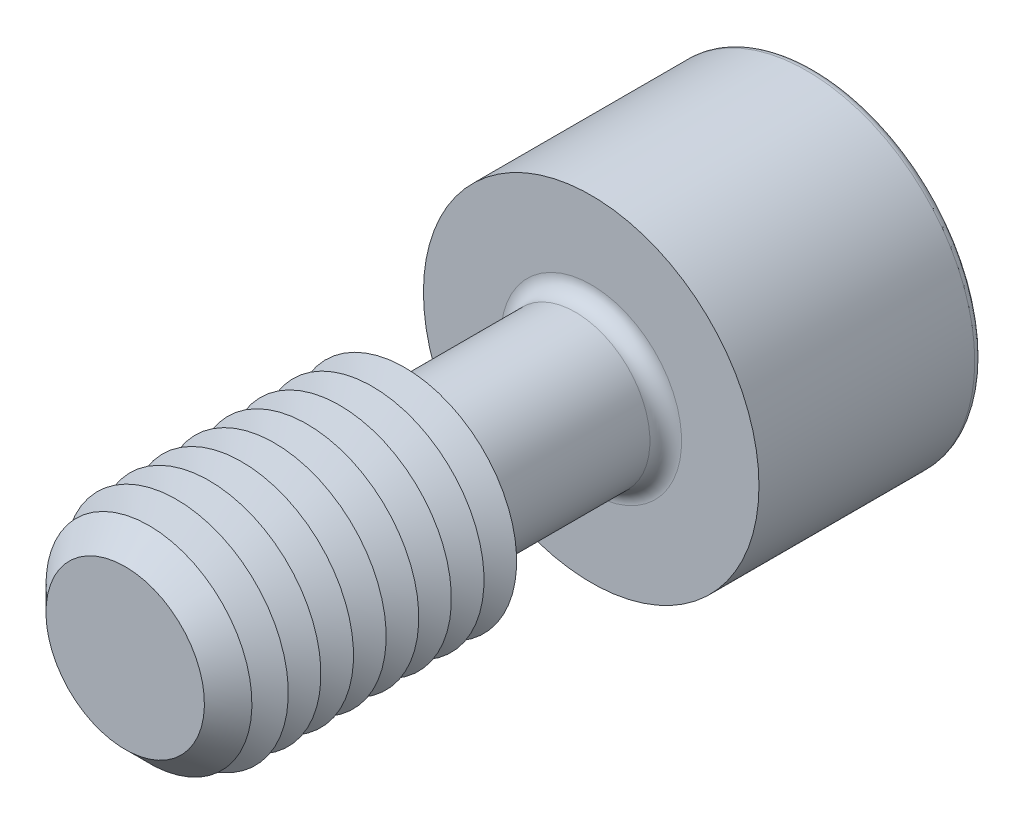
ISO-10303-21;
HEADER;
FILE_DESCRIPTION(('STEP AP214'),'2;1');
FILE_NAME('part.step','',(''),(''),'','','');
FILE_SCHEMA(('AUTOMOTIVE_DESIGN { 1 0 10303 214 1 1 1 1 }'));
ENDSEC;
DATA;
#1=APPLICATION_CONTEXT('core data for automotive mechanical design processes');
#2=APPLICATION_PROTOCOL_DEFINITION('international standard','automotive_design',2000,#1);
#3=PRODUCT_CONTEXT('',#1,'mechanical');
#4=PRODUCT('Part','Part','',(#3));
#5=PRODUCT_RELATED_PRODUCT_CATEGORY('part','',(#4));
#6=PRODUCT_DEFINITION_FORMATION('','',#4);
#7=PRODUCT_DEFINITION_CONTEXT('part definition',#1,'design');
#8=PRODUCT_DEFINITION('design','',#6,#7);
#9=PRODUCT_DEFINITION_SHAPE('','',#8);
#10=(LENGTH_UNIT() NAMED_UNIT(*) SI_UNIT(.MILLI.,.METRE.));
#11=(NAMED_UNIT(*) PLANE_ANGLE_UNIT() SI_UNIT($,.RADIAN.));
#12=(NAMED_UNIT(*) SI_UNIT($,.STERADIAN.) SOLID_ANGLE_UNIT());
#13=UNCERTAINTY_MEASURE_WITH_UNIT(LENGTH_MEASURE(1.E-05),#10,'distance_accuracy_value','');
#14=(GEOMETRIC_REPRESENTATION_CONTEXT(3) GLOBAL_UNCERTAINTY_ASSIGNED_CONTEXT((#13)) GLOBAL_UNIT_ASSIGNED_CONTEXT((#10,
#11,#12)) REPRESENTATION_CONTEXT('',''));
#15=CARTESIAN_POINT('',(0.,0.,0.));
#16=DIRECTION('',(0.,0.,1.));
#17=DIRECTION('',(1.,0.,0.));
#18=AXIS2_PLACEMENT_3D('',#15,#16,#17);
#19=CARTESIAN_POINT('',(-2.88675134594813,-5.,-14.5));
#20=DIRECTION('',(0.,0.,1.));
#21=DIRECTION('',(1.,0.,0.));
#22=AXIS2_PLACEMENT_3D('',#19,#20,#21);
#23=PLANE('',#22);
#24=DIRECTION('',(1.,0.,0.));
#25=VECTOR('',#24,1.);
#26=CARTESIAN_POINT('',(-2.88675134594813,-5.,-14.5));
#27=LINE('',#26,#25);
#28=CARTESIAN_POINT('',(0.,-5.,-14.5));
#29=VERTEX_POINT('',#28);
#30=CARTESIAN_POINT('',(2.88675134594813,-5.,-14.5));
#31=VERTEX_POINT('',#30);
#32=EDGE_CURVE('E761',#29,#31,#27,.T.);
#33=ORIENTED_EDGE('',*,*,#32,.F.);
#34=CARTESIAN_POINT('',(0.,0.,-14.5));
#35=DIRECTION('',(0.,0.,1.));
#36=DIRECTION('',(0.,-1.,0.));
#37=AXIS2_PLACEMENT_3D('',#34,#35,#36);
#38=CIRCLE('',#37,4.99999999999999);
#39=CARTESIAN_POINT('',(4.33012701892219,-2.50000000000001,-14.5));
#40=VERTEX_POINT('',#39);
#41=EDGE_CURVE('E53',#29,#40,#38,.T.);
#42=ORIENTED_EDGE('',*,*,#41,.T.);
#43=DIRECTION('',(0.5,0.866025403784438,0.));
#44=VECTOR('',#43,1.);
#45=CARTESIAN_POINT('',(2.88675134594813,-5.,-14.5));
#46=LINE('',#45,#44);
#47=EDGE_CURVE('E747',#31,#40,#46,.T.);
#48=ORIENTED_EDGE('',*,*,#47,.F.);
#49=EDGE_LOOP('',(#33,#42,#48));
#50=FACE_BOUND('',#49,.T.);
#51=ADVANCED_FACE('F41',(#50),#23,.F.);
#52=CARTESIAN_POINT('',(5.77350269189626,0.,-14.5));
#53=VERTEX_POINT('',#52);
#54=EDGE_CURVE('E758',#40,#53,#46,.T.);
#55=ORIENTED_EDGE('',*,*,#54,.F.);
#56=CARTESIAN_POINT('',(4.33012701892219,2.49999999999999,-14.5));
#57=VERTEX_POINT('',#56);
#58=EDGE_CURVE('E11',#40,#57,#38,.T.);
#59=ORIENTED_EDGE('',*,*,#58,.T.);
#60=DIRECTION('',(-0.5,0.866025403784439,0.));
#61=VECTOR('',#60,1.);
#62=CARTESIAN_POINT('',(5.77350269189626,0.,-14.5));
#63=LINE('',#62,#61);
#64=EDGE_CURVE('E746',#53,#57,#63,.T.);
#65=ORIENTED_EDGE('',*,*,#64,.F.);
#66=EDGE_LOOP('',(#55,#59,#65));
#67=FACE_BOUND('',#66,.T.);
#68=ADVANCED_FACE('F133',(#67),#23,.F.);
#69=CARTESIAN_POINT('',(2.88675134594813,5.,-14.5));
#70=VERTEX_POINT('',#69);
#71=EDGE_CURVE('E741',#57,#70,#63,.T.);
#72=ORIENTED_EDGE('',*,*,#71,.F.);
#73=CARTESIAN_POINT('',(0.,4.99999999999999,-14.5));
#74=VERTEX_POINT('',#73);
#75=EDGE_CURVE('E51',#57,#74,#38,.T.);
#76=ORIENTED_EDGE('',*,*,#75,.T.);
#77=DIRECTION('',(-1.,0.,0.));
#78=VECTOR('',#77,1.);
#79=CARTESIAN_POINT('',(2.88675134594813,5.,-14.5));
#80=LINE('',#79,#78);
#81=EDGE_CURVE('E177',#70,#74,#80,.T.);
#82=ORIENTED_EDGE('',*,*,#81,.F.);
#83=EDGE_LOOP('',(#72,#76,#82));
#84=FACE_BOUND('',#83,.T.);
#85=ADVANCED_FACE('F139',(#84),#23,.F.);
#86=CARTESIAN_POINT('',(-2.88675134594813,5.,-14.5));
#87=VERTEX_POINT('',#86);
#88=EDGE_CURVE('E752',#74,#87,#80,.T.);
#89=ORIENTED_EDGE('',*,*,#88,.F.);
#90=CARTESIAN_POINT('',(-4.33012701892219,2.49999999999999,-14.5));
#91=VERTEX_POINT('',#90);
#92=EDGE_CURVE('E264',#74,#91,#38,.T.);
#93=ORIENTED_EDGE('',*,*,#92,.T.);
#94=DIRECTION('',(-0.5,-0.866025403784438,0.));
#95=VECTOR('',#94,1.);
#96=CARTESIAN_POINT('',(-2.88675134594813,5.,-14.5));
#97=LINE('',#96,#95);
#98=EDGE_CURVE('E176',#87,#91,#97,.T.);
#99=ORIENTED_EDGE('',*,*,#98,.F.);
#100=EDGE_LOOP('',(#89,#93,#99));
#101=FACE_BOUND('',#100,.T.);
#102=ADVANCED_FACE('F157',(#101),#23,.F.);
#103=CARTESIAN_POINT('',(-5.77350269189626,0.,-14.5));
#104=VERTEX_POINT('',#103);
#105=EDGE_CURVE('E170',#91,#104,#97,.T.);
#106=ORIENTED_EDGE('',*,*,#105,.F.);
#107=CARTESIAN_POINT('',(-4.33012701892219,-2.5,-14.5));
#108=VERTEX_POINT('',#107);
#109=EDGE_CURVE('E172',#91,#108,#38,.T.);
#110=ORIENTED_EDGE('',*,*,#109,.T.);
#111=DIRECTION('',(0.5,-0.866025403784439,0.));
#112=VECTOR('',#111,1.);
#113=CARTESIAN_POINT('',(-5.77350269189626,0.,-14.5));
#114=LINE('',#113,#112);
#115=EDGE_CURVE('E174',#104,#108,#114,.T.);
#116=ORIENTED_EDGE('',*,*,#115,.F.);
#117=EDGE_LOOP('',(#106,#110,#116));
#118=FACE_BOUND('',#117,.T.);
#119=ADVANCED_FACE('F146',(#118),#23,.F.);
#120=CARTESIAN_POINT('',(0.,0.,-24.5));
#121=DIRECTION('',(0.,0.,-1.));
#122=DIRECTION('',(-1.,0.,0.));
#123=AXIS2_PLACEMENT_3D('',#120,#121,#122);
#124=PLANE('',#123);
#125=CARTESIAN_POINT('',(0.,0.,-24.5));
#126=DIRECTION('',(0.,0.,-1.));
#127=DIRECTION('',(-1.,0.,0.));
#128=AXIS2_PLACEMENT_3D('',#125,#126,#127);
#129=CIRCLE('',#128,8.575);
#130=CARTESIAN_POINT('',(-8.575,0.,-24.5));
#131=VERTEX_POINT('',#130);
#132=EDGE_CURVE('E250',#131,#131,#129,.T.);
#133=ORIENTED_EDGE('',*,*,#132,.T.);
#134=EDGE_LOOP('',(#133));
#135=FACE_BOUND('',#134,.T.);
#136=DIRECTION('',(-0.5,-0.866025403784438,0.));
#137=VECTOR('',#136,1.);
#138=CARTESIAN_POINT('',(-2.88675134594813,5.,-24.5));
#139=LINE('',#138,#137);
#140=CARTESIAN_POINT('',(-2.88675134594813,5.,-24.5));
#141=VERTEX_POINT('',#140);
#142=CARTESIAN_POINT('',(-5.77350269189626,0.,-24.5));
#143=VERTEX_POINT('',#142);
#144=EDGE_CURVE('E212',#141,#143,#139,.T.);
#145=ORIENTED_EDGE('',*,*,#144,.T.);
#146=DIRECTION('',(0.5,-0.866025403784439,0.));
#147=VECTOR('',#146,1.);
#148=CARTESIAN_POINT('',(-5.77350269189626,0.,-24.5));
#149=LINE('',#148,#147);
#150=CARTESIAN_POINT('',(-2.88675134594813,-5.,-24.5));
#151=VERTEX_POINT('',#150);
#152=EDGE_CURVE('E67',#143,#151,#149,.T.);
#153=ORIENTED_EDGE('',*,*,#152,.T.);
#154=DIRECTION('',(1.,0.,0.));
#155=VECTOR('',#154,1.);
#156=CARTESIAN_POINT('',(-2.88675134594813,-5.,-24.5));
#157=LINE('',#156,#155);
#158=CARTESIAN_POINT('',(2.88675134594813,-5.,-24.5));
#159=VERTEX_POINT('',#158);
#160=EDGE_CURVE('E196',#151,#159,#157,.T.);
#161=ORIENTED_EDGE('',*,*,#160,.T.);
#162=DIRECTION('',(0.5,0.866025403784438,0.));
#163=VECTOR('',#162,1.);
#164=CARTESIAN_POINT('',(2.88675134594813,-5.,-24.5));
#165=LINE('',#164,#163);
#166=CARTESIAN_POINT('',(5.77350269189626,0.,-24.5));
#167=VERTEX_POINT('',#166);
#168=EDGE_CURVE('E200',#159,#167,#165,.T.);
#169=ORIENTED_EDGE('',*,*,#168,.T.);
#170=DIRECTION('',(-0.5,0.866025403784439,0.));
#171=VECTOR('',#170,1.);
#172=CARTESIAN_POINT('',(5.77350269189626,0.,-24.5));
#173=LINE('',#172,#171);
#174=CARTESIAN_POINT('',(2.88675134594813,5.,-24.5));
#175=VERTEX_POINT('',#174);
#176=EDGE_CURVE('E204',#167,#175,#173,.T.);
#177=ORIENTED_EDGE('',*,*,#176,.T.);
#178=DIRECTION('',(-1.,0.,0.));
#179=VECTOR('',#178,1.);
#180=CARTESIAN_POINT('',(2.88675134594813,5.,-24.5));
#181=LINE('',#180,#179);
#182=EDGE_CURVE('E208',#175,#141,#181,.T.);
#183=ORIENTED_EDGE('',*,*,#182,.T.);
#184=EDGE_LOOP('',(#145,#153,#161,#169,#177,#183));
#185=FACE_BOUND('',#184,.T.);
#186=ADVANCED_FACE('F156',(#135,#185),#124,.T.);
#187=CARTESIAN_POINT('',(0.,0.,12.5));
#188=DIRECTION('',(0.,0.,-1.));
#189=DIRECTION('',(-1.,0.,0.));
#190=AXIS2_PLACEMENT_3D('',#187,#188,#189);
#191=CYLINDRICAL_SURFACE('',#190,4.);
#192=CARTESIAN_POINT('',(0.,0.,-11.65));
#193=DIRECTION('',(0.,0.,-1.));
#194=DIRECTION('',(-1.,0.,0.));
#195=AXIS2_PLACEMENT_3D('',#192,#193,#194);
#196=CIRCLE('',#195,4.);
#197=CARTESIAN_POINT('',(-4.,0.,-11.65));
#198=VERTEX_POINT('',#197);
#199=EDGE_CURVE('E247',#198,#198,#196,.F.);
#200=ORIENTED_EDGE('',*,*,#199,.T.);
#201=EDGE_LOOP('',(#200));
#202=FACE_BOUND('',#201,.T.);
#203=CARTESIAN_POINT('',(0.,0.,-3.65470053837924));
#204=DIRECTION('',(0.,0.,-1.));
#205=DIRECTION('',(0.,1.,0.));
#206=AXIS2_PLACEMENT_3D('',#203,#204,#205);
#207=CIRCLE('',#206,4.);
#208=CARTESIAN_POINT('',(0.,4.,-3.65470053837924));
#209=VERTEX_POINT('',#208);
#210=EDGE_CURVE('E235',#209,#209,#207,.T.);
#211=ORIENTED_EDGE('',*,*,#210,.T.);
#212=EDGE_LOOP('',(#211));
#213=FACE_BOUND('',#212,.T.);
#214=ADVANCED_FACE('F163',(#202,#213),#191,.T.);
#215=CARTESIAN_POINT('',(0.,0.,-3.65470053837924));
#216=DIRECTION('',(0.,0.,1.));
#217=DIRECTION('',(0.,-1.,0.));
#218=AXIS2_PLACEMENT_3D('',#215,#216,#217);
#219=CONICAL_SURFACE('',#218,4.,1.0471975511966);
#220=CARTESIAN_POINT('',(0.,0.,-2.5));
#221=DIRECTION('',(0.,0.,-1.));
#222=DIRECTION('',(-1.,0.,0.));
#223=AXIS2_PLACEMENT_3D('',#220,#221,#222);
#224=CIRCLE('',#223,6.);
#225=CARTESIAN_POINT('',(-6.,0.,-2.5));
#226=VERTEX_POINT('',#225);
#227=EDGE_CURVE('E268',#226,#226,#224,.T.);
#228=ORIENTED_EDGE('',*,*,#227,.T.);
#229=EDGE_LOOP('',(#228));
#230=FACE_BOUND('',#229,.T.);
#231=ORIENTED_EDGE('',*,*,#210,.F.);
#232=EDGE_LOOP('',(#231));
#233=FACE_BOUND('',#232,.T.);
#234=ADVANCED_FACE('F510',(#230,#233),#219,.T.);
#235=CARTESIAN_POINT('',(0.,0.,-12.5));
#236=DIRECTION('',(0.,0.,-1.));
#237=DIRECTION('',(-1.,0.,0.));
#238=AXIS2_PLACEMENT_3D('',#235,#236,#237);
#239=PLANE('',#238);
#240=CARTESIAN_POINT('',(0.,0.,-12.5));
#241=DIRECTION('',(0.,0.,-1.));
#242=DIRECTION('',(-1.,0.,0.));
#243=AXIS2_PLACEMENT_3D('',#240,#241,#242);
#244=CIRCLE('',#243,4.85);
#245=CARTESIAN_POINT('',(-4.85,0.,-12.5));
#246=VERTEX_POINT('',#245);
#247=EDGE_CURVE('E243',#246,#246,#244,.T.);
#248=ORIENTED_EDGE('',*,*,#247,.T.);
#249=EDGE_LOOP('',(#248));
#250=FACE_BOUND('',#249,.T.);
#251=CARTESIAN_POINT('',(0.,0.,-12.5));
#252=DIRECTION('',(0.,0.,-1.));
#253=DIRECTION('',(-1.,0.,0.));
#254=AXIS2_PLACEMENT_3D('',#251,#252,#253);
#255=CIRCLE('',#254,9.);
#256=CARTESIAN_POINT('',(-9.,0.,-12.5));
#257=VERTEX_POINT('',#256);
#258=EDGE_CURVE('E231',#257,#257,#255,.T.);
#259=ORIENTED_EDGE('',*,*,#258,.F.);
#260=EDGE_LOOP('',(#259));
#261=FACE_BOUND('',#260,.T.);
#262=ADVANCED_FACE('F503',(#250,#261),#239,.F.);
#263=CARTESIAN_POINT('',(0.,0.,-24.5));
#264=DIRECTION('',(0.,0.,1.));
#265=DIRECTION('',(1.,0.,0.));
#266=AXIS2_PLACEMENT_3D('',#263,#264,#265);
#267=CYLINDRICAL_SURFACE('',#266,9.);
#268=CARTESIAN_POINT('',(0.,0.,-24.075));
#269=DIRECTION('',(0.,0.,-1.));
#270=DIRECTION('',(-1.,0.,0.));
#271=AXIS2_PLACEMENT_3D('',#268,#269,#270);
#272=CIRCLE('',#271,9.);
#273=CARTESIAN_POINT('',(-9.,0.,-24.075));
#274=VERTEX_POINT('',#273);
#275=EDGE_CURVE('E253',#274,#274,#272,.F.);
#276=ORIENTED_EDGE('',*,*,#275,.T.);
#277=EDGE_LOOP('',(#276));
#278=FACE_BOUND('',#277,.T.);
#279=ORIENTED_EDGE('',*,*,#258,.T.);
#280=EDGE_LOOP('',(#279));
#281=FACE_BOUND('',#280,.T.);
#282=ADVANCED_FACE('F509',(#278,#281),#267,.T.);
#283=CARTESIAN_POINT('',(-5.77350269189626,0.,-14.5));
#284=DIRECTION('',(0.866025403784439,0.5,0.));
#285=DIRECTION('',(-0.5,0.866025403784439,0.));
#286=AXIS2_PLACEMENT_3D('',#283,#284,#285);
#287=PLANE('',#286);
#288=ORIENTED_EDGE('',*,*,#152,.F.);
#289=DIRECTION('',(0.,0.,-1.));
#290=VECTOR('',#289,1.);
#291=CARTESIAN_POINT('',(-5.77350269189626,0.,-14.5));
#292=LINE('',#291,#290);
#293=EDGE_CURVE('E186',#104,#143,#292,.T.);
#294=ORIENTED_EDGE('',*,*,#293,.F.);
#295=ORIENTED_EDGE('',*,*,#115,.T.);
#296=CARTESIAN_POINT('',(-2.88675134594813,-5.,-14.5));
#297=VERTEX_POINT('',#296);
#298=EDGE_CURVE('E215',#108,#297,#114,.T.);
#299=ORIENTED_EDGE('',*,*,#298,.T.);
#300=DIRECTION('',(0.,0.,-1.));
#301=VECTOR('',#300,1.);
#302=CARTESIAN_POINT('',(-2.88675134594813,-5.,-14.5));
#303=LINE('',#302,#301);
#304=EDGE_CURVE('E228',#297,#151,#303,.T.);
#305=ORIENTED_EDGE('',*,*,#304,.T.);
#306=EDGE_LOOP('',(#288,#294,#295,#299,#305));
#307=FACE_BOUND('',#306,.T.);
#308=ADVANCED_FACE('F521',(#307),#287,.T.);
#309=CARTESIAN_POINT('',(-2.88675134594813,-5.,-14.5));
#310=DIRECTION('',(0.,1.,0.));
#311=DIRECTION('',(0.,0.,1.));
#312=AXIS2_PLACEMENT_3D('',#309,#310,#311);
#313=PLANE('',#312);
#314=ORIENTED_EDGE('',*,*,#160,.F.);
#315=ORIENTED_EDGE('',*,*,#304,.F.);
#316=EDGE_CURVE('E759',#297,#29,#27,.T.);
#317=ORIENTED_EDGE('',*,*,#316,.T.);
#318=ORIENTED_EDGE('',*,*,#32,.T.);
#319=DIRECTION('',(0.,0.,-1.));
#320=VECTOR('',#319,1.);
#321=CARTESIAN_POINT('',(2.88675134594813,-5.,-14.5));
#322=LINE('',#321,#320);
#323=EDGE_CURVE('E225',#31,#159,#322,.T.);
#324=ORIENTED_EDGE('',*,*,#323,.T.);
#325=EDGE_LOOP('',(#314,#315,#317,#318,#324));
#326=FACE_BOUND('',#325,.T.);
#327=ADVANCED_FACE('F537',(#326),#313,.T.);
#328=CARTESIAN_POINT('',(2.88675134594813,-5.,-14.5));
#329=DIRECTION('',(-0.866025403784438,0.5,0.));
#330=DIRECTION('',(-0.5,-0.866025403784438,0.));
#331=AXIS2_PLACEMENT_3D('',#328,#329,#330);
#332=PLANE('',#331);
#333=ORIENTED_EDGE('',*,*,#168,.F.);
#334=ORIENTED_EDGE('',*,*,#323,.F.);
#335=ORIENTED_EDGE('',*,*,#47,.T.);
#336=ORIENTED_EDGE('',*,*,#54,.T.);
#337=DIRECTION('',(0.,0.,-1.));
#338=VECTOR('',#337,1.);
#339=CARTESIAN_POINT('',(5.77350269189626,0.,-14.5));
#340=LINE('',#339,#338);
#341=EDGE_CURVE('E222',#53,#167,#340,.T.);
#342=ORIENTED_EDGE('',*,*,#341,.T.);
#343=EDGE_LOOP('',(#333,#334,#335,#336,#342));
#344=FACE_BOUND('',#343,.T.);
#345=ADVANCED_FACE('F547',(#344),#332,.T.);
#346=CARTESIAN_POINT('',(5.77350269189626,0.,-14.5));
#347=DIRECTION('',(-0.866025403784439,-0.5,0.));
#348=DIRECTION('',(0.5,-0.866025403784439,0.));
#349=AXIS2_PLACEMENT_3D('',#346,#347,#348);
#350=PLANE('',#349);
#351=ORIENTED_EDGE('',*,*,#176,.F.);
#352=ORIENTED_EDGE('',*,*,#341,.F.);
#353=ORIENTED_EDGE('',*,*,#64,.T.);
#354=ORIENTED_EDGE('',*,*,#71,.T.);
#355=DIRECTION('',(0.,0.,-1.));
#356=VECTOR('',#355,1.);
#357=CARTESIAN_POINT('',(2.88675134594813,5.,-14.5));
#358=LINE('',#357,#356);
#359=EDGE_CURVE('E219',#70,#175,#358,.T.);
#360=ORIENTED_EDGE('',*,*,#359,.T.);
#361=EDGE_LOOP('',(#351,#352,#353,#354,#360));
#362=FACE_BOUND('',#361,.T.);
#363=ADVANCED_FACE('F557',(#362),#350,.T.);
#364=CARTESIAN_POINT('',(2.88675134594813,5.,-14.5));
#365=DIRECTION('',(0.,-1.,0.));
#366=DIRECTION('',(0.,0.,-1.));
#367=AXIS2_PLACEMENT_3D('',#364,#365,#366);
#368=PLANE('',#367);
#369=ORIENTED_EDGE('',*,*,#182,.F.);
#370=ORIENTED_EDGE('',*,*,#359,.F.);
#371=ORIENTED_EDGE('',*,*,#81,.T.);
#372=ORIENTED_EDGE('',*,*,#88,.T.);
#373=DIRECTION('',(0.,0.,-1.));
#374=VECTOR('',#373,1.);
#375=CARTESIAN_POINT('',(-2.88675134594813,5.,-14.5));
#376=LINE('',#375,#374);
#377=EDGE_CURVE('E182',#87,#141,#376,.T.);
#378=ORIENTED_EDGE('',*,*,#377,.T.);
#379=EDGE_LOOP('',(#369,#370,#371,#372,#378));
#380=FACE_BOUND('',#379,.T.);
#381=ADVANCED_FACE('F152',(#380),#368,.T.);
#382=CARTESIAN_POINT('',(-2.88675134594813,5.,-14.5));
#383=DIRECTION('',(0.866025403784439,-0.5,0.));
#384=DIRECTION('',(0.5,0.866025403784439,0.));
#385=AXIS2_PLACEMENT_3D('',#382,#383,#384);
#386=PLANE('',#385);
#387=ORIENTED_EDGE('',*,*,#144,.F.);
#388=ORIENTED_EDGE('',*,*,#377,.F.);
#389=ORIENTED_EDGE('',*,*,#98,.T.);
#390=ORIENTED_EDGE('',*,*,#105,.T.);
#391=ORIENTED_EDGE('',*,*,#293,.T.);
#392=EDGE_LOOP('',(#387,#388,#389,#390,#391));
#393=FACE_BOUND('',#392,.T.);
#394=ADVANCED_FACE('F144',(#393),#386,.T.);
#395=ORIENTED_EDGE('',*,*,#298,.F.);
#396=EDGE_CURVE('E256',#108,#29,#38,.T.);
#397=ORIENTED_EDGE('',*,*,#396,.T.);
#398=ORIENTED_EDGE('',*,*,#316,.F.);
#399=EDGE_LOOP('',(#395,#397,#398));
#400=FACE_BOUND('',#399,.T.);
#401=ADVANCED_FACE('F135',(#400),#23,.F.);
#402=CARTESIAN_POINT('',(0.,0.,-11.65));
#403=DIRECTION('',(0.,0.,-1.));
#404=DIRECTION('',(-1.,0.,0.));
#405=AXIS2_PLACEMENT_3D('',#402,#403,#404);
#406=TOROIDAL_SURFACE('',#405,4.85,0.85);
#407=ORIENTED_EDGE('',*,*,#199,.F.);
#408=EDGE_LOOP('',(#407));
#409=FACE_BOUND('',#408,.T.);
#410=ORIENTED_EDGE('',*,*,#247,.F.);
#411=EDGE_LOOP('',(#410));
#412=FACE_BOUND('',#411,.T.);
#413=ADVANCED_FACE('F129',(#409,#412),#406,.F.);
#414=CARTESIAN_POINT('',(0.,0.,-24.075));
#415=DIRECTION('',(0.,0.,-1.));
#416=DIRECTION('',(-1.,0.,0.));
#417=AXIS2_PLACEMENT_3D('',#414,#415,#416);
#418=TOROIDAL_SURFACE('',#417,8.575,0.425);
#419=ORIENTED_EDGE('',*,*,#275,.F.);
#420=EDGE_LOOP('',(#419));
#421=FACE_BOUND('',#420,.T.);
#422=ORIENTED_EDGE('',*,*,#132,.F.);
#423=EDGE_LOOP('',(#422));
#424=FACE_BOUND('',#423,.T.);
#425=ADVANCED_FACE('F43',(#421,#424),#418,.T.);
#426=CARTESIAN_POINT('',(0.,0.,-11.6132486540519));
#427=DIRECTION('',(0.,0.,-1.));
#428=DIRECTION('',(0.,1.,0.));
#429=AXIS2_PLACEMENT_3D('',#426,#427,#428);
#430=CONICAL_SURFACE('',#429,0.,1.0471975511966);
#431=ORIENTED_EDGE('',*,*,#41,.F.);
#432=ORIENTED_EDGE('',*,*,#396,.F.);
#433=ORIENTED_EDGE('',*,*,#109,.F.);
#434=ORIENTED_EDGE('',*,*,#92,.F.);
#435=ORIENTED_EDGE('',*,*,#75,.F.);
#436=ORIENTED_EDGE('',*,*,#58,.F.);
#437=EDGE_LOOP('',(#431,#432,#433,#434,#435,#436));
#438=FACE_BOUND('',#437,.T.);
#439=CARTESIAN_POINT('',(0.,0.,-11.6132486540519));
#440=VERTEX_POINT('',#439);
#441=VERTEX_LOOP('',#440);
#442=FACE_BOUND('',#441,.T.);
#443=ADVANCED_FACE('F118',(#438,#442),#430,.F.);
#444=CARTESIAN_POINT('',(0.,0.,-1.625));
#445=DIRECTION('',(0.,0.,-1.));
#446=DIRECTION('',(-1.,0.,0.));
#447=AXIS2_PLACEMENT_3D('',#444,#445,#446);
#448=CONICAL_SURFACE('',#447,4.48445554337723,1.0471975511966);
#449=ORIENTED_EDGE('',*,*,#227,.F.);
#450=EDGE_LOOP('',(#449));
#451=FACE_BOUND('',#450,.T.);
#452=CARTESIAN_POINT('',(0.,0.,-1.625));
#453=DIRECTION('',(0.,0.,-1.));
#454=DIRECTION('',(-1.,0.,0.));
#455=AXIS2_PLACEMENT_3D('',#452,#453,#454);
#456=CIRCLE('',#455,4.48445554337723);
#457=CARTESIAN_POINT('',(-4.48445554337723,0.,-1.625));
#458=VERTEX_POINT('',#457);
#459=EDGE_CURVE('E275',#458,#458,#456,.T.);
#460=ORIENTED_EDGE('',*,*,#459,.T.);
#461=EDGE_LOOP('',(#460));
#462=FACE_BOUND('',#461,.T.);
#463=ADVANCED_FACE('F120',(#451,#462),#448,.T.);
#464=CARTESIAN_POINT('',(0.,0.,-0.749999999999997));
#465=DIRECTION('',(0.,0.,1.));
#466=DIRECTION('',(1.,0.,0.));
#467=AXIS2_PLACEMENT_3D('',#464,#465,#466);
#468=CONICAL_SURFACE('',#467,6.,1.0471975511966);
#469=ORIENTED_EDGE('',*,*,#459,.F.);
#470=EDGE_LOOP('',(#469));
#471=FACE_BOUND('',#470,.T.);
#472=CARTESIAN_POINT('',(0.,0.,-0.749999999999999));
#473=DIRECTION('',(0.,0.,-1.));
#474=DIRECTION('',(-1.,0.,0.));
#475=AXIS2_PLACEMENT_3D('',#472,#473,#474);
#476=CIRCLE('',#475,6.);
#477=CARTESIAN_POINT('',(-6.,0.,-0.749999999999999));
#478=VERTEX_POINT('',#477);
#479=EDGE_CURVE('E280',#478,#478,#476,.T.);
#480=ORIENTED_EDGE('',*,*,#479,.T.);
#481=EDGE_LOOP('',(#480));
#482=FACE_BOUND('',#481,.T.);
#483=ADVANCED_FACE('F126',(#471,#482),#468,.T.);
#484=CARTESIAN_POINT('',(0.,0.,0.125000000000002));
#485=DIRECTION('',(0.,0.,-1.));
#486=DIRECTION('',(-1.,0.,0.));
#487=AXIS2_PLACEMENT_3D('',#484,#485,#486);
#488=CONICAL_SURFACE('',#487,4.48445554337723,1.0471975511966);
#489=ORIENTED_EDGE('',*,*,#479,.F.);
#490=EDGE_LOOP('',(#489));
#491=FACE_BOUND('',#490,.T.);
#492=CARTESIAN_POINT('',(0.,0.,0.125000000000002));
#493=DIRECTION('',(0.,0.,-1.));
#494=DIRECTION('',(-1.,0.,0.));
#495=AXIS2_PLACEMENT_3D('',#492,#493,#494);
#496=CIRCLE('',#495,4.48445554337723);
#497=CARTESIAN_POINT('',(-4.48445554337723,0.,0.125000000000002));
#498=VERTEX_POINT('',#497);
#499=EDGE_CURVE('E285',#498,#498,#496,.T.);
#500=ORIENTED_EDGE('',*,*,#499,.T.);
#501=EDGE_LOOP('',(#500));
#502=FACE_BOUND('',#501,.T.);
#503=ADVANCED_FACE('F397',(#491,#502),#488,.T.);
#504=CARTESIAN_POINT('',(0.,0.,1.));
#505=DIRECTION('',(0.,0.,1.));
#506=DIRECTION('',(1.,0.,0.));
#507=AXIS2_PLACEMENT_3D('',#504,#505,#506);
#508=CONICAL_SURFACE('',#507,6.,1.0471975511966);
#509=ORIENTED_EDGE('',*,*,#499,.F.);
#510=EDGE_LOOP('',(#509));
#511=FACE_BOUND('',#510,.T.);
#512=CARTESIAN_POINT('',(0.,0.,1.));
#513=DIRECTION('',(0.,0.,-1.));
#514=DIRECTION('',(-1.,0.,0.));
#515=AXIS2_PLACEMENT_3D('',#512,#513,#514);
#516=CIRCLE('',#515,6.);
#517=CARTESIAN_POINT('',(-6.,0.,1.));
#518=VERTEX_POINT('',#517);
#519=EDGE_CURVE('E289',#518,#518,#516,.T.);
#520=ORIENTED_EDGE('',*,*,#519,.T.);
#521=EDGE_LOOP('',(#520));
#522=FACE_BOUND('',#521,.T.);
#523=ADVANCED_FACE('F393',(#511,#522),#508,.T.);
#524=CARTESIAN_POINT('',(0.,0.,1.875));
#525=DIRECTION('',(0.,0.,-1.));
#526=DIRECTION('',(-1.,0.,0.));
#527=AXIS2_PLACEMENT_3D('',#524,#525,#526);
#528=CONICAL_SURFACE('',#527,4.48445554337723,1.0471975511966);
#529=ORIENTED_EDGE('',*,*,#519,.F.);
#530=EDGE_LOOP('',(#529));
#531=FACE_BOUND('',#530,.T.);
#532=CARTESIAN_POINT('',(0.,0.,1.875));
#533=DIRECTION('',(0.,0.,-1.));
#534=DIRECTION('',(-1.,0.,0.));
#535=AXIS2_PLACEMENT_3D('',#532,#533,#534);
#536=CIRCLE('',#535,4.48445554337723);
#537=CARTESIAN_POINT('',(-4.48445554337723,0.,1.875));
#538=VERTEX_POINT('',#537);
#539=EDGE_CURVE('E293',#538,#538,#536,.T.);
#540=ORIENTED_EDGE('',*,*,#539,.T.);
#541=EDGE_LOOP('',(#540));
#542=FACE_BOUND('',#541,.T.);
#543=ADVANCED_FACE('F389',(#531,#542),#528,.T.);
#544=CARTESIAN_POINT('',(0.,0.,2.75));
#545=DIRECTION('',(0.,0.,1.));
#546=DIRECTION('',(1.,0.,0.));
#547=AXIS2_PLACEMENT_3D('',#544,#545,#546);
#548=CONICAL_SURFACE('',#547,6.,1.0471975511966);
#549=ORIENTED_EDGE('',*,*,#539,.F.);
#550=EDGE_LOOP('',(#549));
#551=FACE_BOUND('',#550,.T.);
#552=CARTESIAN_POINT('',(0.,0.,2.75));
#553=DIRECTION('',(0.,0.,-1.));
#554=DIRECTION('',(-1.,0.,0.));
#555=AXIS2_PLACEMENT_3D('',#552,#553,#554);
#556=CIRCLE('',#555,6.);
#557=CARTESIAN_POINT('',(-6.,0.,2.75));
#558=VERTEX_POINT('',#557);
#559=EDGE_CURVE('E297',#558,#558,#556,.T.);
#560=ORIENTED_EDGE('',*,*,#559,.T.);
#561=EDGE_LOOP('',(#560));
#562=FACE_BOUND('',#561,.T.);
#563=ADVANCED_FACE('F385',(#551,#562),#548,.T.);
#564=CARTESIAN_POINT('',(0.,0.,3.625));
#565=DIRECTION('',(0.,0.,-1.));
#566=DIRECTION('',(-1.,0.,0.));
#567=AXIS2_PLACEMENT_3D('',#564,#565,#566);
#568=CONICAL_SURFACE('',#567,4.48445554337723,1.0471975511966);
#569=ORIENTED_EDGE('',*,*,#559,.F.);
#570=EDGE_LOOP('',(#569));
#571=FACE_BOUND('',#570,.T.);
#572=CARTESIAN_POINT('',(0.,0.,3.625));
#573=DIRECTION('',(0.,0.,-1.));
#574=DIRECTION('',(-1.,0.,0.));
#575=AXIS2_PLACEMENT_3D('',#572,#573,#574);
#576=CIRCLE('',#575,4.48445554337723);
#577=CARTESIAN_POINT('',(-4.48445554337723,0.,3.625));
#578=VERTEX_POINT('',#577);
#579=EDGE_CURVE('E301',#578,#578,#576,.T.);
#580=ORIENTED_EDGE('',*,*,#579,.T.);
#581=EDGE_LOOP('',(#580));
#582=FACE_BOUND('',#581,.T.);
#583=ADVANCED_FACE('F381',(#571,#582),#568,.T.);
#584=CARTESIAN_POINT('',(0.,0.,4.5));
#585=DIRECTION('',(0.,0.,1.));
#586=DIRECTION('',(1.,0.,0.));
#587=AXIS2_PLACEMENT_3D('',#584,#585,#586);
#588=CONICAL_SURFACE('',#587,6.,1.0471975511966);
#589=ORIENTED_EDGE('',*,*,#579,.F.);
#590=EDGE_LOOP('',(#589));
#591=FACE_BOUND('',#590,.T.);
#592=CARTESIAN_POINT('',(0.,0.,4.5));
#593=DIRECTION('',(0.,0.,-1.));
#594=DIRECTION('',(-1.,0.,0.));
#595=AXIS2_PLACEMENT_3D('',#592,#593,#594);
#596=CIRCLE('',#595,6.);
#597=CARTESIAN_POINT('',(-6.,0.,4.5));
#598=VERTEX_POINT('',#597);
#599=EDGE_CURVE('E305',#598,#598,#596,.T.);
#600=ORIENTED_EDGE('',*,*,#599,.T.);
#601=EDGE_LOOP('',(#600));
#602=FACE_BOUND('',#601,.T.);
#603=ADVANCED_FACE('F377',(#591,#602),#588,.T.);
#604=CARTESIAN_POINT('',(0.,0.,5.375));
#605=DIRECTION('',(0.,0.,-1.));
#606=DIRECTION('',(-1.,0.,0.));
#607=AXIS2_PLACEMENT_3D('',#604,#605,#606);
#608=CONICAL_SURFACE('',#607,4.48445554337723,1.0471975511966);
#609=ORIENTED_EDGE('',*,*,#599,.F.);
#610=EDGE_LOOP('',(#609));
#611=FACE_BOUND('',#610,.T.);
#612=CARTESIAN_POINT('',(0.,0.,5.375));
#613=DIRECTION('',(0.,0.,-1.));
#614=DIRECTION('',(-1.,0.,0.));
#615=AXIS2_PLACEMENT_3D('',#612,#613,#614);
#616=CIRCLE('',#615,4.48445554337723);
#617=CARTESIAN_POINT('',(-4.48445554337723,0.,5.375));
#618=VERTEX_POINT('',#617);
#619=EDGE_CURVE('E308',#618,#618,#616,.T.);
#620=ORIENTED_EDGE('',*,*,#619,.T.);
#621=EDGE_LOOP('',(#620));
#622=FACE_BOUND('',#621,.T.);
#623=ADVANCED_FACE('F373',(#611,#622),#608,.T.);
#624=CARTESIAN_POINT('',(0.,0.,6.25));
#625=DIRECTION('',(0.,0.,1.));
#626=DIRECTION('',(1.,0.,0.));
#627=AXIS2_PLACEMENT_3D('',#624,#625,#626);
#628=CONICAL_SURFACE('',#627,6.,1.0471975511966);
#629=ORIENTED_EDGE('',*,*,#619,.F.);
#630=EDGE_LOOP('',(#629));
#631=FACE_BOUND('',#630,.T.);
#632=CARTESIAN_POINT('',(0.,0.,6.25));
#633=DIRECTION('',(0.,0.,-1.));
#634=DIRECTION('',(-1.,0.,0.));
#635=AXIS2_PLACEMENT_3D('',#632,#633,#634);
#636=CIRCLE('',#635,6.);
#637=CARTESIAN_POINT('',(-6.,0.,6.25));
#638=VERTEX_POINT('',#637);
#639=EDGE_CURVE('E312',#638,#638,#636,.T.);
#640=ORIENTED_EDGE('',*,*,#639,.T.);
#641=EDGE_LOOP('',(#640));
#642=FACE_BOUND('',#641,.T.);
#643=ADVANCED_FACE('F369',(#631,#642),#628,.T.);
#644=CARTESIAN_POINT('',(0.,0.,7.125));
#645=DIRECTION('',(0.,0.,-1.));
#646=DIRECTION('',(-1.,0.,0.));
#647=AXIS2_PLACEMENT_3D('',#644,#645,#646);
#648=CONICAL_SURFACE('',#647,4.48445554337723,1.0471975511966);
#649=ORIENTED_EDGE('',*,*,#639,.F.);
#650=EDGE_LOOP('',(#649));
#651=FACE_BOUND('',#650,.T.);
#652=CARTESIAN_POINT('',(0.,0.,7.125));
#653=DIRECTION('',(0.,0.,-1.));
#654=DIRECTION('',(-1.,0.,0.));
#655=AXIS2_PLACEMENT_3D('',#652,#653,#654);
#656=CIRCLE('',#655,4.48445554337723);
#657=CARTESIAN_POINT('',(-4.48445554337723,0.,7.125));
#658=VERTEX_POINT('',#657);
#659=EDGE_CURVE('E316',#658,#658,#656,.T.);
#660=ORIENTED_EDGE('',*,*,#659,.T.);
#661=EDGE_LOOP('',(#660));
#662=FACE_BOUND('',#661,.T.);
#663=ADVANCED_FACE('F365',(#651,#662),#648,.T.);
#664=CARTESIAN_POINT('',(0.,0.,8.));
#665=DIRECTION('',(0.,0.,1.));
#666=DIRECTION('',(1.,0.,0.));
#667=AXIS2_PLACEMENT_3D('',#664,#665,#666);
#668=CONICAL_SURFACE('',#667,6.,1.0471975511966);
#669=ORIENTED_EDGE('',*,*,#659,.F.);
#670=EDGE_LOOP('',(#669));
#671=FACE_BOUND('',#670,.T.);
#672=CARTESIAN_POINT('',(0.,0.,8.));
#673=DIRECTION('',(0.,0.,-1.));
#674=DIRECTION('',(-1.,0.,0.));
#675=AXIS2_PLACEMENT_3D('',#672,#673,#674);
#676=CIRCLE('',#675,6.);
#677=CARTESIAN_POINT('',(-6.,0.,8.));
#678=VERTEX_POINT('',#677);
#679=EDGE_CURVE('E319',#678,#678,#676,.T.);
#680=ORIENTED_EDGE('',*,*,#679,.T.);
#681=EDGE_LOOP('',(#680));
#682=FACE_BOUND('',#681,.T.);
#683=ADVANCED_FACE('F361',(#671,#682),#668,.T.);
#684=CARTESIAN_POINT('',(0.,0.,8.875));
#685=DIRECTION('',(0.,0.,-1.));
#686=DIRECTION('',(-1.,0.,0.));
#687=AXIS2_PLACEMENT_3D('',#684,#685,#686);
#688=CONICAL_SURFACE('',#687,4.48445554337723,1.0471975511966);
#689=ORIENTED_EDGE('',*,*,#679,.F.);
#690=EDGE_LOOP('',(#689));
#691=FACE_BOUND('',#690,.T.);
#692=CARTESIAN_POINT('',(0.,0.,8.875));
#693=DIRECTION('',(0.,0.,-1.));
#694=DIRECTION('',(-1.,0.,0.));
#695=AXIS2_PLACEMENT_3D('',#692,#693,#694);
#696=CIRCLE('',#695,4.48445554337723);
#697=CARTESIAN_POINT('',(-4.48445554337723,0.,8.875));
#698=VERTEX_POINT('',#697);
#699=EDGE_CURVE('E323',#698,#698,#696,.T.);
#700=ORIENTED_EDGE('',*,*,#699,.T.);
#701=EDGE_LOOP('',(#700));
#702=FACE_BOUND('',#701,.T.);
#703=ADVANCED_FACE('F357',(#691,#702),#688,.T.);
#704=CARTESIAN_POINT('',(0.,0.,9.75));
#705=DIRECTION('',(0.,0.,1.));
#706=DIRECTION('',(1.,0.,0.));
#707=AXIS2_PLACEMENT_3D('',#704,#705,#706);
#708=CONICAL_SURFACE('',#707,6.,1.0471975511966);
#709=ORIENTED_EDGE('',*,*,#699,.F.);
#710=EDGE_LOOP('',(#709));
#711=FACE_BOUND('',#710,.T.);
#712=CARTESIAN_POINT('',(0.,0.,9.75));
#713=DIRECTION('',(0.,0.,-1.));
#714=DIRECTION('',(-1.,0.,0.));
#715=AXIS2_PLACEMENT_3D('',#712,#713,#714);
#716=CIRCLE('',#715,6.);
#717=CARTESIAN_POINT('',(-6.,0.,9.75));
#718=VERTEX_POINT('',#717);
#719=EDGE_CURVE('E327',#718,#718,#716,.T.);
#720=ORIENTED_EDGE('',*,*,#719,.T.);
#721=EDGE_LOOP('',(#720));
#722=FACE_BOUND('',#721,.T.);
#723=ADVANCED_FACE('F350',(#711,#722),#708,.T.);
#724=CARTESIAN_POINT('',(0.,0.,10.625));
#725=DIRECTION('',(0.,0.,-1.));
#726=DIRECTION('',(-1.,0.,0.));
#727=AXIS2_PLACEMENT_3D('',#724,#725,#726);
#728=CONICAL_SURFACE('',#727,4.48445554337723,1.0471975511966);
#729=ORIENTED_EDGE('',*,*,#719,.F.);
#730=EDGE_LOOP('',(#729));
#731=FACE_BOUND('',#730,.T.);
#732=CARTESIAN_POINT('',(0.,0.,10.625));
#733=DIRECTION('',(0.,0.,-1.));
#734=DIRECTION('',(-1.,0.,0.));
#735=AXIS2_PLACEMENT_3D('',#732,#733,#734);
#736=CIRCLE('',#735,4.48445554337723);
#737=CARTESIAN_POINT('',(-4.48445554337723,0.,10.625));
#738=VERTEX_POINT('',#737);
#739=EDGE_CURVE('E331',#738,#738,#736,.T.);
#740=ORIENTED_EDGE('',*,*,#739,.T.);
#741=EDGE_LOOP('',(#740));
#742=FACE_BOUND('',#741,.T.);
#743=ADVANCED_FACE('F336',(#731,#742),#728,.T.);
#744=CARTESIAN_POINT('',(0.,0.,11.5));
#745=DIRECTION('',(0.,0.,1.));
#746=DIRECTION('',(1.,0.,0.));
#747=AXIS2_PLACEMENT_3D('',#744,#745,#746);
#748=CONICAL_SURFACE('',#747,6.,1.0471975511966);
#749=CARTESIAN_POINT('',(0.,0.,11.2254809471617));
#750=DIRECTION('',(0.,0.,1.));
#751=DIRECTION('',(1.,0.,0.));
#752=AXIS2_PLACEMENT_3D('',#749,#750,#751);
#753=CIRCLE('',#752,5.52451905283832);
#754=CARTESIAN_POINT('',(0.,5.52451905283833,11.2254809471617));
#755=VERTEX_POINT('',#754);
#756=EDGE_CURVE('E45',#755,#755,#753,.F.);
#757=ORIENTED_EDGE('',*,*,#756,.T.);
#758=EDGE_LOOP('',(#757));
#759=FACE_BOUND('',#758,.T.);
#760=ORIENTED_EDGE('',*,*,#739,.F.);
#761=EDGE_LOOP('',(#760));
#762=FACE_BOUND('',#761,.T.);
#763=ADVANCED_FACE('F338',(#759,#762),#748,.T.);
#764=CARTESIAN_POINT('',(0.,0.,12.5));
#765=DIRECTION('',(0.,0.,1.));
#766=DIRECTION('',(1.,0.,0.));
#767=AXIS2_PLACEMENT_3D('',#764,#765,#766);
#768=PLANE('',#767);
#769=CARTESIAN_POINT('',(0.,0.,12.5));
#770=DIRECTION('',(0.,0.,1.));
#771=DIRECTION('',(1.,0.,0.));
#772=AXIS2_PLACEMENT_3D('',#769,#770,#771);
#773=CIRCLE('',#772,4.24999999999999);
#774=CARTESIAN_POINT('',(0.,4.24999999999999,12.5));
#775=VERTEX_POINT('',#774);
#776=EDGE_CURVE('E239',#775,#775,#773,.T.);
#777=ORIENTED_EDGE('',*,*,#776,.T.);
#778=EDGE_LOOP('',(#777));
#779=FACE_BOUND('',#778,.T.);
#780=ADVANCED_FACE('F340',(#779),#768,.T.);
#781=CARTESIAN_POINT('',(0.,0.,10.75));
#782=DIRECTION('',(0.,0.,-1.));
#783=DIRECTION('',(0.,1.,0.));
#784=AXIS2_PLACEMENT_3D('',#781,#782,#783);
#785=CONICAL_SURFACE('',#784,6.,0.78539816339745);
#786=CARTESIAN_POINT('',(0.,5.52451905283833,11.2254809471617));
#787=CARTESIAN_POINT('',(0.,5.5112428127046,11.2387571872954));
#788=CARTESIAN_POINT('',(0.,5.49796657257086,11.2520334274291));
#789=CARTESIAN_POINT('',(0.,5.4714140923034,11.2785859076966));
#790=CARTESIAN_POINT('',(0.,5.45813785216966,11.2918621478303));
#791=CARTESIAN_POINT('',(0.,5.4315853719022,11.3184146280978));
#792=CARTESIAN_POINT('',(0.,5.41830913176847,11.3316908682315));
#793=CARTESIAN_POINT('',(0.,5.391756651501,11.358243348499));
#794=CARTESIAN_POINT('',(0.,5.37848041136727,11.3715195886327));
#795=CARTESIAN_POINT('',(0.,5.3519279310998,11.3980720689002));
#796=CARTESIAN_POINT('',(0.,5.33865169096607,11.4113483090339));
#797=CARTESIAN_POINT('',(0.,5.31209921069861,11.4379007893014));
#798=CARTESIAN_POINT('',(0.,5.29882297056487,11.4511770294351));
#799=CARTESIAN_POINT('',(0.,5.27227049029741,11.4777295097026));
#800=CARTESIAN_POINT('',(0.,5.25899425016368,11.4910057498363));
#801=CARTESIAN_POINT('',(0.,5.23244176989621,11.5175582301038));
#802=CARTESIAN_POINT('',(0.,5.21916552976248,11.5308344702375));
#803=CARTESIAN_POINT('',(0.,5.19261304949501,11.557386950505));
#804=CARTESIAN_POINT('',(0.,5.17933680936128,11.5706631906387));
#805=CARTESIAN_POINT('',(0.,5.15278432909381,11.5972156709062));
#806=CARTESIAN_POINT('',(0.,5.13950808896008,11.6104919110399));
#807=CARTESIAN_POINT('',(0.,5.11295560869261,11.6370443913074));
#808=CARTESIAN_POINT('',(0.,5.09967936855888,11.6503206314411));
#809=CARTESIAN_POINT('',(0.,5.07312688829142,11.6768731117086));
#810=CARTESIAN_POINT('',(0.,5.05985064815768,11.6901493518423));
#811=CARTESIAN_POINT('',(0.,5.03329816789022,11.7167018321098));
#812=CARTESIAN_POINT('',(0.,5.02002192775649,11.7299780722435));
#813=CARTESIAN_POINT('',(0.,4.99346944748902,11.756530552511));
#814=CARTESIAN_POINT('',(0.,4.98019320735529,11.7698067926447));
#815=CARTESIAN_POINT('',(0.,4.95364072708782,11.7963592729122));
#816=CARTESIAN_POINT('',(0.,4.94036448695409,11.8096355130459));
#817=CARTESIAN_POINT('',(0.,4.91381200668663,11.8361879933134));
#818=CARTESIAN_POINT('',(0.,4.90053576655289,11.8494642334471));
#819=CARTESIAN_POINT('',(0.,4.87398328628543,11.8760167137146));
#820=CARTESIAN_POINT('',(0.,4.86070704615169,11.8892929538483));
#821=CARTESIAN_POINT('',(0.,4.83415456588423,11.9158454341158));
#822=CARTESIAN_POINT('',(0.,4.8208783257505,11.9291216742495));
#823=CARTESIAN_POINT('',(0.,4.79432584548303,11.955674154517));
#824=CARTESIAN_POINT('',(0.,4.7810496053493,11.9689503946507));
#825=CARTESIAN_POINT('',(0.,4.75449712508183,11.9955028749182));
#826=CARTESIAN_POINT('',(0.,4.7412208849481,12.0087791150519));
#827=CARTESIAN_POINT('',(0.,4.71466840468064,12.0353315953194));
#828=CARTESIAN_POINT('',(0.,4.7013921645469,12.0486078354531));
#829=CARTESIAN_POINT('',(0.,4.67483968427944,12.0751603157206));
#830=CARTESIAN_POINT('',(0.,4.66156344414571,12.0884365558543));
#831=CARTESIAN_POINT('',(0.,4.63501096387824,12.1149890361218));
#832=CARTESIAN_POINT('',(0.,4.62173472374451,12.1282652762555));
#833=CARTESIAN_POINT('',(0.,4.59518224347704,12.154817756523));
#834=CARTESIAN_POINT('',(0.,4.58190600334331,12.1680939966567));
#835=CARTESIAN_POINT('',(0.,4.55535352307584,12.1946464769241));
#836=CARTESIAN_POINT('',(0.,4.54207728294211,12.2079227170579));
#837=CARTESIAN_POINT('',(0.,4.51552480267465,12.2344751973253));
#838=CARTESIAN_POINT('',(0.,4.50224856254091,12.2477514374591));
#839=CARTESIAN_POINT('',(0.,4.47569608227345,12.2743039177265));
#840=CARTESIAN_POINT('',(0.,4.46241984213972,12.2875801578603));
#841=CARTESIAN_POINT('',(0.,4.43586736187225,12.3141326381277));
#842=CARTESIAN_POINT('',(0.,4.42259112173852,12.3274088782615));
#843=CARTESIAN_POINT('',(0.,4.39603864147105,12.3539613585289));
#844=CARTESIAN_POINT('',(0.,4.38276240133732,12.3672375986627));
#845=CARTESIAN_POINT('',(0.,4.35620992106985,12.3937900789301));
#846=CARTESIAN_POINT('',(0.,4.34293368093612,12.4070663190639));
#847=CARTESIAN_POINT('',(0.,4.31638120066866,12.4336187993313));
#848=CARTESIAN_POINT('',(0.,4.30310496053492,12.4468950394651));
#849=CARTESIAN_POINT('',(0.,4.27655248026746,12.4734475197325));
#850=CARTESIAN_POINT('',(0.,4.26327624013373,12.4867237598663));
#851=CARTESIAN_POINT('',(0.,4.24999999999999,12.5));
#852=B_SPLINE_CURVE_WITH_KNOTS('',3,(#786,#787,#788,#789,#790,#791,#792,#793,#794,#795,#796,
#797,#798,#799,#800,#801,#802,#803,#804,#805,#806,#807,#808,#809,#810,#811,#812,#813,#814,#815,
#816,#817,#818,#819,#820,#821,#822,#823,#824,#825,#826,#827,#828,#829,#830,#831,#832,#833,#834,
#835,#836,#837,#838,#839,#840,#841,#842,#843,#844,#845,#846,#847,#848,#849,#850,#851),
.UNSPECIFIED.,.F.,.F.,(4,2,2,2,2,2,2,2,2,2,2,2,2,2,2,2,2,2,2,2,2,2,2,2,2,2,2,2,2,2,2,2,4),(0.,
0.0563263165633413,0.112652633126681,0.168978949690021,0.22530526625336,0.2816315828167,
0.337957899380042,0.394284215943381,0.450610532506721,0.50693684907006,0.563263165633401,
0.61958948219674,0.675915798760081,0.732242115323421,0.788568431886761,0.8448947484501,
0.90122106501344,0.957547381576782,1.01387369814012,1.07020001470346,1.1265263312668,
1.18285264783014,1.23917896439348,1.29550528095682,1.35183159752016,1.4081579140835,
1.46448423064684,1.52081054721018,1.57713686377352,1.63346318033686,1.6897894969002,
1.74611581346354,1.80244213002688),.UNSPECIFIED.);
#853=EDGE_CURVE('BSEAM347',#755,#775,#852,.T.);
#854=ORIENTED_EDGE('',*,*,#756,.F.);
#855=ORIENTED_EDGE('',*,*,#776,.F.);
#856=ORIENTED_EDGE('',*,*,#853,.T.);
#857=ORIENTED_EDGE('',*,*,#853,.F.);
#858=EDGE_LOOP('',(#854,#856,#855,#857));
#859=FACE_BOUND('',#858,.T.);
#860=ADVANCED_FACE('F347',(#859),#785,.T.);
#861=CLOSED_SHELL('',(#51,#68,#85,#102,#119,#186,#214,#234,#262,#282,#308,#327,#345,#363,#381,
#394,#401,#413,#425,#443,#463,#483,#503,#523,#543,#563,#583,#603,#623,#643,#663,#683,#703,#723,
#743,#763,#780,#860));
#862=MANIFOLD_SOLID_BREP('B2',#861);
#863=ADVANCED_BREP_SHAPE_REPRESENTATION('',(#18,#862),#14);
#864=SHAPE_DEFINITION_REPRESENTATION(#9,#863);
ENDSEC;
END-ISO-10303-21;
